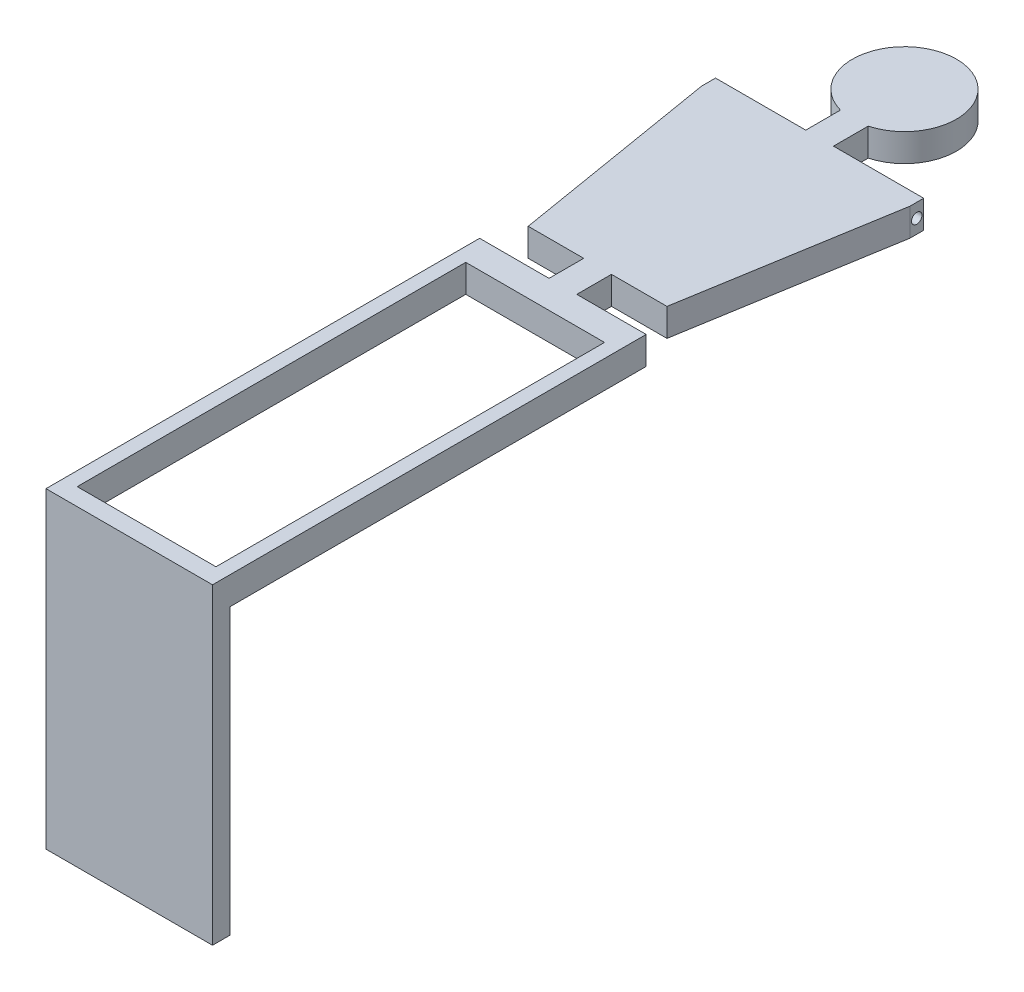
from build123d import *

# Parameters (mm, degrees)
BOSS_EXTRU_1_DEPTH      = 8
ESQUISSE2_W             = 48
ESQUISSE2_H             = 5
BOSS_EXTRU_2_DEPTH      = 90
ESQUISSE3_R             = 1.5
ENL_V_MAT_EXTRU_1_DEPTH = 255.609686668


with BuildPart() as part:
    # Esquisse1 → Boss.-Extru.1 (new body)
    with BuildSketch(Plane(origin=(0, 0, 0), x_dir=(1, 0, 0), z_dir=(0, 1, 0))):
        with BuildLine():
            Line((0, 0), (0, 120))
            Line((0, 120), (-20, 120))
            Line((-20, 120), (-20, 130))
            Line((-20, 130), (-4, 130))
            Line((-4, 130), (6, 190))
            Line((6, 190), (6, 194))
            Line((6, 194), (-20, 194))
            Line((-20, 194), (-20, 204))
            ThreePointArc((-20, 204), (-24, 233.456832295), (-28, 204))
            Line((-28, 204), (-28, 194))
            Line((-28, 194), (-54, 194))
            Line((-54, 194), (-54, 190))
            Line((-54, 190), (-44, 130))
            Line((-44, 130), (-28, 130))
            Line((-28, 130), (-28, 120))
            Line((-28, 120), (-48, 120))
            Line((-48, 120), (-48, 0))
            Line((-48, 0), (-44, 0))
            Line((-44, 0), (-44, 112))
            Line((-44, 112), (-4, 112))
            Line((-4, 112), (-4, 0))
            Line((-4, 0), (0, 0))
        make_face()
    extrude(amount=BOSS_EXTRU_1_DEPTH)

    # Esquisse2 → Boss.-Extru.2 (add)
    with BuildSketch(Plane(origin=(0, 8, 0), x_dir=(1, 0, 0), z_dir=(0, 1, 0))):
        with Locations((-24, -2.5)):
            Rectangle(ESQUISSE2_W, ESQUISSE2_H)
    extrude(amount=-BOSS_EXTRU_2_DEPTH)

    # Esquisse3 → Enl_v. mat.-Extru.1 (cut, through all)
    with BuildSketch(Plane.ZY.offset(54)):
        with Locations((-192, 4)):
            Circle(ESQUISSE3_R)
    extrude(amount=-ENL_V_MAT_EXTRU_1_DEPTH, mode=Mode.SUBTRACT)


solid = part.part
